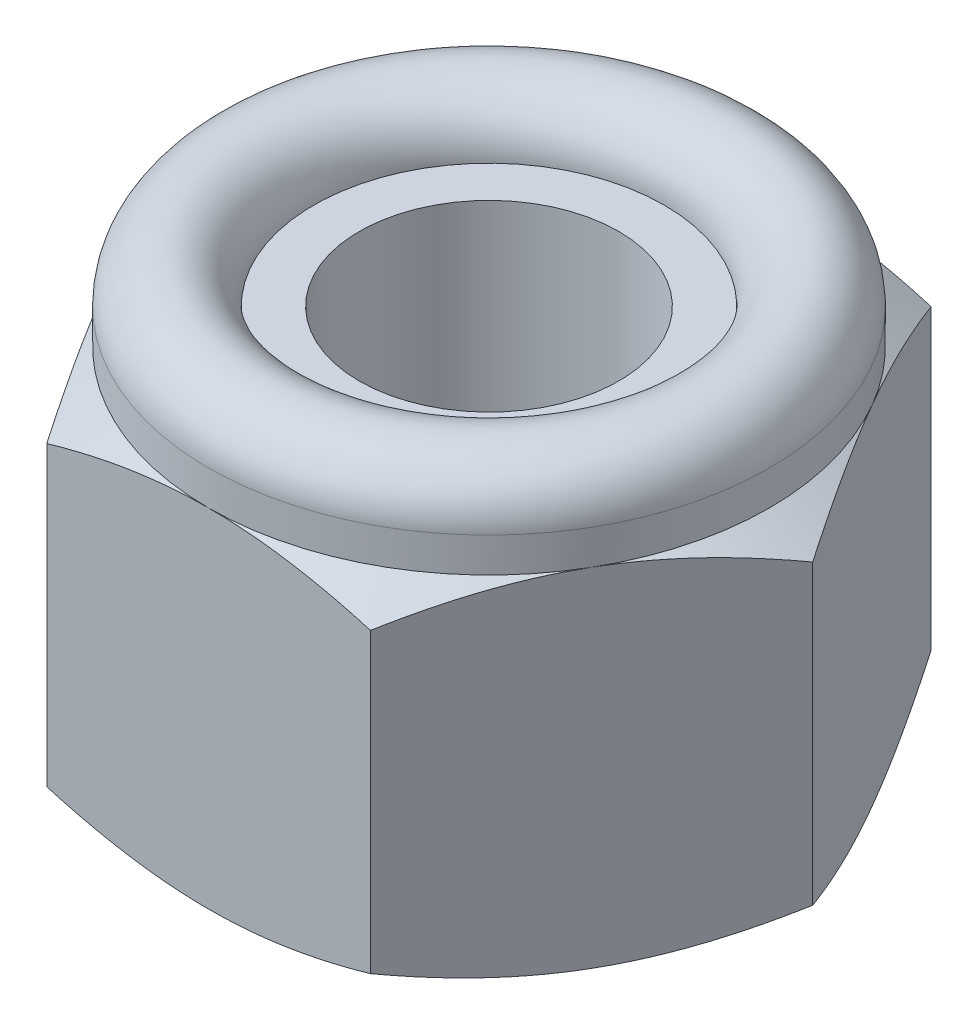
ISO-10303-21;
HEADER;
FILE_DESCRIPTION(('STEP AP214'),'2;1');
FILE_NAME('part.step','',(''),(''),'','','');
FILE_SCHEMA(('AUTOMOTIVE_DESIGN { 1 0 10303 214 1 1 1 1 }'));
ENDSEC;
DATA;
#1=APPLICATION_CONTEXT('core data for automotive mechanical design processes');
#2=APPLICATION_PROTOCOL_DEFINITION('international standard','automotive_design',2000,#1);
#3=PRODUCT_CONTEXT('',#1,'mechanical');
#4=PRODUCT('Part','Part','',(#3));
#5=PRODUCT_RELATED_PRODUCT_CATEGORY('part','',(#4));
#6=PRODUCT_DEFINITION_FORMATION('','',#4);
#7=PRODUCT_DEFINITION_CONTEXT('part definition',#1,'design');
#8=PRODUCT_DEFINITION('design','',#6,#7);
#9=PRODUCT_DEFINITION_SHAPE('','',#8);
#10=(LENGTH_UNIT() NAMED_UNIT(*) SI_UNIT(.MILLI.,.METRE.));
#11=(NAMED_UNIT(*) PLANE_ANGLE_UNIT() SI_UNIT($,.RADIAN.));
#12=(NAMED_UNIT(*) SI_UNIT($,.STERADIAN.) SOLID_ANGLE_UNIT());
#13=UNCERTAINTY_MEASURE_WITH_UNIT(LENGTH_MEASURE(1.E-05),#10,'distance_accuracy_value','');
#14=(GEOMETRIC_REPRESENTATION_CONTEXT(3) GLOBAL_UNCERTAINTY_ASSIGNED_CONTEXT((#13)) GLOBAL_UNIT_ASSIGNED_CONTEXT((#10,
#11,#12)) REPRESENTATION_CONTEXT('',''));
#15=CARTESIAN_POINT('',(0.,0.,0.));
#16=DIRECTION('',(0.,0.,1.));
#17=DIRECTION('',(1.,0.,0.));
#18=AXIS2_PLACEMENT_3D('',#15,#16,#17);
#19=CARTESIAN_POINT('',(0.,0.,0.));
#20=DIRECTION('',(0.,1.,0.));
#21=DIRECTION('',(0.,0.,1.));
#22=AXIS2_PLACEMENT_3D('',#19,#20,#21);
#23=CONICAL_SURFACE('',#22,8.,1.04719754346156);
#24=CARTESIAN_POINT('',(9.23771977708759,0.714597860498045,0.000200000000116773));
#25=CARTESIAN_POINT('',(9.13619343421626,0.655990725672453,-0.175648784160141));
#26=CARTESIAN_POINT('',(9.0342885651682,0.600043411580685,-0.352153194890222));
#27=CARTESIAN_POINT('',(8.82965122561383,0.494201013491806,-0.706595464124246));
#28=CARTESIAN_POINT('',(8.72691841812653,0.444308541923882,-0.884533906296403));
#29=CARTESIAN_POINT('',(8.41707512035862,0.304692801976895,-1.42119824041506));
#30=CARTESIAN_POINT('',(8.20874154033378,0.225281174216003,-1.78204258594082));
#31=CARTESIAN_POINT('',(7.89697436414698,0.132161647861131,-2.32203917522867));
#32=CARTESIAN_POINT('',(7.79447216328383,0.105634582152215,-2.4995781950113));
#33=CARTESIAN_POINT('',(7.58900421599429,0.0611531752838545,-2.85545911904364));
#34=CARTESIAN_POINT('',(7.4860385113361,0.0431980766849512,-3.03380095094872));
#35=CARTESIAN_POINT('',(7.27992981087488,0.0163156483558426,-3.39079169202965));
#36=CARTESIAN_POINT('',(7.1767871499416,0.00737807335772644,-3.56944002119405));
#37=CARTESIAN_POINT('',(6.97040654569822,-0.00127769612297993,-3.92690171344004));
#38=CARTESIAN_POINT('',(6.86716860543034,-0.000996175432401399,-4.10571507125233));
#39=CARTESIAN_POINT('',(6.67416138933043,0.00814502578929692,-4.44001337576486));
#40=CARTESIAN_POINT('',(6.58437849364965,0.0158896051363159,-4.59552191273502));
#41=CARTESIAN_POINT('',(6.40502298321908,0.0382011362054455,-4.90617476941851));
#42=CARTESIAN_POINT('',(6.3154503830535,0.0527685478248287,-5.06131906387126));
#43=CARTESIAN_POINT('',(6.04707935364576,0.106360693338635,-5.52615132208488));
#44=CARTESIAN_POINT('',(5.8687559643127,0.155268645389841,-5.83501649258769));
#45=CARTESIAN_POINT('',(5.51021755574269,0.277539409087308,-6.45602323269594));
#46=CARTESIAN_POINT('',(5.33004829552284,0.351420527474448,-6.76808554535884));
#47=CARTESIAN_POINT('',(4.97239658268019,0.519100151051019,-7.38755648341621));
#48=CARTESIAN_POINT('',(4.79490954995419,0.612859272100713,-7.6949730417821));
#49=CARTESIAN_POINT('',(4.61868668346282,0.71459786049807,-8.00020000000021));
#50=B_SPLINE_CURVE_WITH_KNOTS('',3,(#24,#25,#26,#27,#28,#29,#30,#31,#32,#33,#34,#35,#36,#37,#38,
#39,#40,#41,#42,#43,#44,#45,#46,#47,#48,#49),.UNSPECIFIED.,.F.,.F.,(4,2,2,2,2,2,2,2,2,2,2,2,4),
(0.,0.63397354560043,1.26821966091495,2.53934713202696,3.15934344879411,3.77928497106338,
4.39852135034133,5.01773859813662,5.55680240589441,6.09590255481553,7.17487078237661,
8.27776850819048,9.37850115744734),.UNSPECIFIED.);
#51=CARTESIAN_POINT('',(9.23760430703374,0.714531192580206,0.));
#52=VERTEX_POINT('',#51);
#53=CARTESIAN_POINT('',(6.92820323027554,0.,-3.99999999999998));
#54=VERTEX_POINT('',#53);
#55=EDGE_CURVE('E233',#52,#54,#50,.T.);
#56=ORIENTED_EDGE('',*,*,#55,.F.);
#57=CARTESIAN_POINT('',(4.61868668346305,0.71459786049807,8.00019999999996));
#58=CARTESIAN_POINT('',(4.72021302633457,0.655990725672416,7.82435121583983));
#59=CARTESIAN_POINT('',(4.82211789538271,0.60004341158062,7.6478468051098));
#60=CARTESIAN_POINT('',(5.02675523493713,0.494201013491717,7.29340453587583));
#61=CARTESIAN_POINT('',(5.12948804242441,0.444308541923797,7.11546609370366));
#62=CARTESIAN_POINT('',(5.43933134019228,0.304692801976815,6.578801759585));
#63=CARTESIAN_POINT('',(5.64766492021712,0.225281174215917,6.21795741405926));
#64=CARTESIAN_POINT('',(5.95943209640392,0.132161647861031,5.67796082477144));
#65=CARTESIAN_POINT('',(6.06193429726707,0.105634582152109,5.50042180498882));
#66=CARTESIAN_POINT('',(6.2674022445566,0.0611531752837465,5.14454088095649));
#67=CARTESIAN_POINT('',(6.37036794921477,0.0431980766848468,4.96619904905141));
#68=CARTESIAN_POINT('',(6.57647664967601,0.0163156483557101,4.6092083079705));
#69=CARTESIAN_POINT('',(6.67961931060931,0.00737807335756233,4.43055997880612));
#70=CARTESIAN_POINT('',(6.88599991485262,-0.00127769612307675,4.0730982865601));
#71=CARTESIAN_POINT('',(6.9892378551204,-0.0009961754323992,3.89428492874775));
#72=CARTESIAN_POINT('',(7.18224507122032,0.00814502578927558,3.55998662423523));
#73=CARTESIAN_POINT('',(7.27202796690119,0.0158896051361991,3.40447808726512));
#74=CARTESIAN_POINT('',(7.45138347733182,0.0382011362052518,3.09382523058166));
#75=CARTESIAN_POINT('',(7.54095607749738,0.0527685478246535,2.9386809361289));
#76=CARTESIAN_POINT('',(7.80932710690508,0.106360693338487,2.47384867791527));
#77=CARTESIAN_POINT('',(7.98765049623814,0.155268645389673,2.16498350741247));
#78=CARTESIAN_POINT('',(8.34618890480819,0.277539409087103,1.54397676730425));
#79=CARTESIAN_POINT('',(8.52635816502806,0.351420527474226,1.23191445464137));
#80=CARTESIAN_POINT('',(8.88400987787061,0.51910015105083,0.612443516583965));
#81=CARTESIAN_POINT('',(9.06149691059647,0.612859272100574,0.305026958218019));
#82=CARTESIAN_POINT('',(9.23771977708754,0.714597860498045,-0.000200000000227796));
#83=B_SPLINE_CURVE_WITH_KNOTS('',3,(#57,#58,#59,#60,#61,#62,#63,#64,#65,#66,#67,#68,#69,#70,#71,
#72,#73,#74,#75,#76,#77,#78,#79,#80,#81,#82),.UNSPECIFIED.,.F.,.F.,(4,2,2,2,2,2,2,2,2,2,2,2,4),
(0.,0.633973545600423,1.26821966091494,2.5393471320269,3.15934344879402,3.77928497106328,
4.39852135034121,5.01773859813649,5.55680240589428,6.0959025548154,7.17487078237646,
8.2777685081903,9.37850115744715),.UNSPECIFIED.);
#84=CARTESIAN_POINT('',(6.92820323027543,0.,4.));
#85=VERTEX_POINT('',#84);
#86=EDGE_CURVE('E149',#85,#52,#83,.T.);
#87=ORIENTED_EDGE('',*,*,#86,.F.);
#88=CARTESIAN_POINT('',(0.,0.,0.));
#89=DIRECTION('',(0.,-1.,0.));
#90=DIRECTION('',(0.,0.,-1.));
#91=AXIS2_PLACEMENT_3D('',#88,#89,#90);
#92=CIRCLE('',#91,8.);
#93=EDGE_CURVE('E246',#54,#85,#92,.T.);
#94=ORIENTED_EDGE('',*,*,#93,.F.);
#95=EDGE_LOOP('',(#56,#87,#94));
#96=FACE_BOUND('',#95,.T.);
#97=ADVANCED_FACE('F31',(#96),#23,.T.);
#98=CARTESIAN_POINT('',(4.61880215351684,0.714531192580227,-7.99999999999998));
#99=VERTEX_POINT('',#98);
#100=EDGE_CURVE('E228',#54,#99,#50,.T.);
#101=ORIENTED_EDGE('',*,*,#100,.F.);
#102=CARTESIAN_POINT('',(-9.43689570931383E-13,0.,-8.00000000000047));
#103=VERTEX_POINT('',#102);
#104=EDGE_CURVE('E244',#103,#54,#92,.T.);
#105=ORIENTED_EDGE('',*,*,#104,.F.);
#106=CARTESIAN_POINT('',(-12.4167804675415,3.90912140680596,-8.00000000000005));
#107=CARTESIAN_POINT('',(-12.0672904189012,3.73954675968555,-8.00000000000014));
#108=CARTESIAN_POINT('',(-11.7169992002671,3.57159510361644,-8.00000000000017));
#109=CARTESIAN_POINT('',(-11.0143884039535,3.23985034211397,-8.0000000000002));
#110=CARTESIAN_POINT('',(-10.662068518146,3.0760578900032,-8.00000000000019));
#111=CARTESIAN_POINT('',(-9.95316389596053,2.75272220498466,-8.00000000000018));
#112=CARTESIAN_POINT('',(-9.59656638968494,2.59320687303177,-8.00000000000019));
#113=CARTESIAN_POINT('',(-8.88053881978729,2.28069032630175,-8.00000000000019));
#114=CARTESIAN_POINT('',(-8.52110889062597,2.1276888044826,-8.00000000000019));
#115=CARTESIAN_POINT('',(-7.78718797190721,1.82511354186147,-8.00000000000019));
#116=CARTESIAN_POINT('',(-7.41258514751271,1.67580956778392,-8.00000000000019));
#117=CARTESIAN_POINT('',(-6.65900149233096,1.38847696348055,-8.00000000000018));
#118=CARTESIAN_POINT('',(-6.28002017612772,1.25044959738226,-8.00000000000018));
#119=CARTESIAN_POINT('',(-5.51777815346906,0.989286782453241,-8.0000000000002));
#120=CARTESIAN_POINT('',(-5.13452785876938,0.866121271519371,-8.00000000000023));
#121=CARTESIAN_POINT('',(-4.36254331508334,0.638626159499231,-8.00000000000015));
#122=CARTESIAN_POINT('',(-3.97381083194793,0.534290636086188,-8.00000000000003));
#123=CARTESIAN_POINT('',(-3.1927450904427,0.350020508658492,-8.00000000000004));
#124=CARTESIAN_POINT('',(-2.80044412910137,0.269952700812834,-8.00000000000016));
#125=CARTESIAN_POINT('',(-2.20841205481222,0.17151093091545,-8.0000000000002));
#126=CARTESIAN_POINT('',(-2.01045675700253,0.142305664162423,-8.00000000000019));
#127=CARTESIAN_POINT('',(-1.61355877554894,0.0916877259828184,-8.00000000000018));
#128=CARTESIAN_POINT('',(-1.41461618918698,0.0702743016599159,-8.00000000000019));
#129=CARTESIAN_POINT('',(-1.01861322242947,0.0359357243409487,-8.00000000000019));
#130=CARTESIAN_POINT('',(-0.821562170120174,0.0229034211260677,-8.00000000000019));
#131=CARTESIAN_POINT('',(-0.427085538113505,0.00518384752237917,-8.00000000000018));
#132=CARTESIAN_POINT('',(-0.229659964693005,0.000496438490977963,-8.00000000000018));
#133=CARTESIAN_POINT('',(0.165212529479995,-0.000421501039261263,-8.0000000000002));
#134=CARTESIAN_POINT('',(0.362659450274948,0.00334798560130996,-8.00000000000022));
#135=CARTESIAN_POINT('',(0.757218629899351,0.019251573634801,-8.00000000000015));
#136=CARTESIAN_POINT('',(0.954330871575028,0.031386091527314,-8.00000000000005));
#137=CARTESIAN_POINT('',(1.42775544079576,0.070319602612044,-8.00000000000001));
#138=CARTESIAN_POINT('',(1.70374960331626,0.101071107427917,-8.00000000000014));
#139=CARTESIAN_POINT('',(2.25368308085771,0.177298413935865,-8.00000000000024));
#140=CARTESIAN_POINT('',(2.52762211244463,0.2227762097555,-8.0000000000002));
#141=CARTESIAN_POINT('',(3.34604788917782,0.378887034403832,-8.00000000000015));
#142=CARTESIAN_POINT('',(3.88683594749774,0.509168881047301,-8.00000000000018));
#143=CARTESIAN_POINT('',(4.695445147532,0.735008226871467,-8.00000000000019));
#144=CARTESIAN_POINT('',(4.96746291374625,0.816403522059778,-8.00000000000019));
#145=CARTESIAN_POINT('',(5.50885646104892,0.9876295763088,-8.00000000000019));
#146=CARTESIAN_POINT('',(5.77823222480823,1.07746039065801,-8.00000000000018));
#147=CARTESIAN_POINT('',(6.31442655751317,1.26411776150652,-8.00000000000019));
#148=CARTESIAN_POINT('',(6.58124594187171,1.36094199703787,-8.00000000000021));
#149=CARTESIAN_POINT('',(7.11267558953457,1.56044886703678,-8.00000000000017));
#150=CARTESIAN_POINT('',(7.37728587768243,1.66313143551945,-8.0000000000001));
#151=CARTESIAN_POINT('',(7.997388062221,1.91040587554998,-8.00000000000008));
#152=CARTESIAN_POINT('',(8.35207087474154,2.05702285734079,-8.00000000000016));
#153=CARTESIAN_POINT('',(9.05844713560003,2.35730974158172,-8.00000000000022));
#154=CARTESIAN_POINT('',(9.41014040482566,2.51098006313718,-8.0000000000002));
#155=CARTESIAN_POINT('',(10.1110880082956,2.82397393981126,-8.00000000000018));
#156=CARTESIAN_POINT('',(10.4603417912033,2.98329872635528,-8.00000000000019));
#157=CARTESIAN_POINT('',(11.156736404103,3.30647150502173,-8.00000000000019));
#158=CARTESIAN_POINT('',(11.5038772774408,3.47031940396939,-8.00000000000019));
#159=CARTESIAN_POINT('',(12.196766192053,3.80187654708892,-8.00000000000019));
#160=CARTESIAN_POINT('',(12.5425123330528,3.96958975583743,-8.00000000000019));
#161=CARTESIAN_POINT('',(13.2325145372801,4.30805667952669,-8.00000000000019));
#162=CARTESIAN_POINT('',(13.5767705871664,4.47881042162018,-8.00000000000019));
#163=CARTESIAN_POINT('',(14.6075665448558,4.99478520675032,-8.00000000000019));
#164=CARTESIAN_POINT('',(15.2922253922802,5.34376377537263,-8.00000000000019));
#165=CARTESIAN_POINT('',(16.6012395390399,6.01954126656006,-8.00000000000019));
#166=CARTESIAN_POINT('',(17.2258859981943,6.34577871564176,-8.00000000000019));
#167=CARTESIAN_POINT('',(18.4728402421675,7.00274168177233,-8.00000000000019));
#168=CARTESIAN_POINT('',(19.0951479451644,7.3334673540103,-8.00000000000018));
#169=CARTESIAN_POINT('',(20.3364009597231,7.99752000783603,-8.00000000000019));
#170=CARTESIAN_POINT('',(20.9553507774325,8.33083857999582,-8.0000000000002));
#171=CARTESIAN_POINT('',(22.1917522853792,9.00016359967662,-8.00000000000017));
#172=CARTESIAN_POINT('',(22.8092040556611,9.33616989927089,-8.00000000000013));
#173=CARTESIAN_POINT('',(23.4261032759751,9.67318079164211,-8.00000000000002));
#174=B_SPLINE_CURVE_WITH_KNOTS('',3,(#106,#107,#108,#109,#110,#111,#112,#113,#114,#115,#116,
#117,#118,#119,#120,#121,#122,#123,#124,#125,#126,#127,#128,#129,#130,#131,#132,#133,#134,#135,
#136,#137,#138,#139,#140,#141,#142,#143,#144,#145,#146,#147,#148,#149,#150,#151,#152,#153,#154,
#155,#156,#157,#158,#159,#160,#161,#162,#163,#164,#165,#166,#167,#168,#169,#170,#171,#172,#173),
.UNSPECIFIED.,.F.,.F.,(4,2,2,2,2,2,2,2,2,2,2,2,2,2,2,2,2,2,2,2,2,2,2,2,2,2,2,2,2,2,2,2,2,4),(0.,
1.16538523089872,2.33095240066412,3.50284826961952,4.67468883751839,5.88432916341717,
7.09410490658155,8.30139100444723,9.50829672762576,10.7084525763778,11.3086176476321,
11.9087247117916,12.5009984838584,13.0932624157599,13.6855275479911,14.2778221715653,
15.110457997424,15.9432066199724,17.6096258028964,18.4613586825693,19.3130971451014,
20.1645542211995,21.0160017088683,22.1672759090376,23.3186186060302,24.4702135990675,
25.6217848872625,26.7745950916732,27.9274155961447,30.2327530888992,32.3468591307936,
34.4610384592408,36.5700125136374,38.6788712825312),.UNSPECIFIED.);
#175=EDGE_CURVE('E335',#99,#103,#174,.F.);
#176=ORIENTED_EDGE('',*,*,#175,.F.);
#177=EDGE_LOOP('',(#101,#105,#176));
#178=FACE_BOUND('',#177,.T.);
#179=ADVANCED_FACE('F265',(#178),#23,.T.);
#180=CARTESIAN_POINT('',(-4.61880215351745,0.71453119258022,-8.00000000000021));
#181=VERTEX_POINT('',#180);
#182=EDGE_CURVE('E205',#103,#181,#174,.F.);
#183=ORIENTED_EDGE('',*,*,#182,.F.);
#184=CARTESIAN_POINT('',(-6.92820323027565,0.,-4.00000000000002));
#185=VERTEX_POINT('',#184);
#186=EDGE_CURVE('E242',#185,#103,#92,.T.);
#187=ORIENTED_EDGE('',*,*,#186,.F.);
#188=CARTESIAN_POINT('',(-4.61868668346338,0.714597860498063,-8.00020000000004));
#189=CARTESIAN_POINT('',(-4.7202130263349,0.655990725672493,-7.82435121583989));
#190=CARTESIAN_POINT('',(-4.82211789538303,0.600043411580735,-7.64784680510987));
#191=CARTESIAN_POINT('',(-5.02675523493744,0.494201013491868,-7.2934045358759));
#192=CARTESIAN_POINT('',(-5.12948804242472,0.444308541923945,-7.11546609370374));
#193=CARTESIAN_POINT('',(-5.43933134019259,0.304692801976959,-6.5788017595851));
#194=CARTESIAN_POINT('',(-5.64766492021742,0.22528117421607,-6.21795741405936));
#195=CARTESIAN_POINT('',(-5.95943209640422,0.132161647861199,-5.67796082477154));
#196=CARTESIAN_POINT('',(-6.06193429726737,0.105634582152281,-5.50042180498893));
#197=CARTESIAN_POINT('',(-6.26740224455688,0.0611531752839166,-5.1445408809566));
#198=CARTESIAN_POINT('',(-6.37036794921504,0.0431980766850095,-4.96619904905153));
#199=CARTESIAN_POINT('',(-6.5764766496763,0.0163156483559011,-4.60920830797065));
#200=CARTESIAN_POINT('',(-6.67961931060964,0.00737807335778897,-4.4305599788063));
#201=CARTESIAN_POINT('',(-6.88599991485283,-0.00127769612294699,-4.07309828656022));
#202=CARTESIAN_POINT('',(-6.98923785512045,-0.000996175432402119,-3.89428492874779));
#203=CARTESIAN_POINT('',(-7.18224507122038,0.00814502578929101,-3.5599866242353));
#204=CARTESIAN_POINT('',(-7.27202796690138,0.0158896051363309,-3.40447808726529));
#205=CARTESIAN_POINT('',(-7.4513834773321,0.0382011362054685,-3.09382523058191));
#206=CARTESIAN_POINT('',(-7.54095607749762,0.0527685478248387,-2.93868093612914));
#207=CARTESIAN_POINT('',(-7.80932710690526,0.106360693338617,-2.4738486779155));
#208=CARTESIAN_POINT('',(-7.98765049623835,0.155268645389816,-2.16498350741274));
#209=CARTESIAN_POINT('',(-8.34618890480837,0.277539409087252,-1.54397676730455));
#210=CARTESIAN_POINT('',(-8.52635816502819,0.351420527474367,-1.23191445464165));
#211=CARTESIAN_POINT('',(-8.88400987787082,0.519100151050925,-0.612443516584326));
#212=CARTESIAN_POINT('',(-9.06149691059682,0.61285927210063,-0.305026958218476));
#213=CARTESIAN_POINT('',(-9.23771977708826,0.714597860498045,0.000199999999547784));
#214=B_SPLINE_CURVE_WITH_KNOTS('',3,(#188,#189,#190,#191,#192,#193,#194,#195,#196,#197,#198,
#199,#200,#201,#202,#203,#204,#205,#206,#207,#208,#209,#210,#211,#212,#213),.UNSPECIFIED.,.F.,
.F.,(4,2,2,2,2,2,2,2,2,2,2,2,4),(0.,0.633973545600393,1.26821966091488,2.53934713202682,
3.15934344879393,3.77928497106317,4.39852135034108,5.01773859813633,5.55680240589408,
6.09590255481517,7.17487078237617,8.27776850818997,9.37850115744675),.UNSPECIFIED.);
#215=EDGE_CURVE('E200',#181,#185,#214,.T.);
#216=ORIENTED_EDGE('',*,*,#215,.F.);
#217=EDGE_LOOP('',(#183,#187,#216));
#218=FACE_BOUND('',#217,.T.);
#219=ADVANCED_FACE('F270',(#218),#23,.T.);
#220=CARTESIAN_POINT('',(-9.2376043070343,0.714531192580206,-3.88578058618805E-13));
#221=VERTEX_POINT('',#220);
#222=EDGE_CURVE('E201',#185,#221,#214,.T.);
#223=ORIENTED_EDGE('',*,*,#222,.F.);
#224=CARTESIAN_POINT('',(-6.92820323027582,0.,3.99999999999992));
#225=VERTEX_POINT('',#224);
#226=EDGE_CURVE('E307',#225,#185,#92,.T.);
#227=ORIENTED_EDGE('',*,*,#226,.F.);
#228=CARTESIAN_POINT('',(-9.23771977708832,0.714597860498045,-0.000200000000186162));
#229=CARTESIAN_POINT('',(-9.13619343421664,0.655990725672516,0.175648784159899));
#230=CARTESIAN_POINT('',(-9.03428856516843,0.600043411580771,0.35215319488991));
#231=CARTESIAN_POINT('',(-8.82965122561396,0.494201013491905,0.706595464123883));
#232=CARTESIAN_POINT('',(-8.72691841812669,0.444308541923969,0.88453390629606));
#233=CARTESIAN_POINT('',(-8.41707512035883,0.304692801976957,1.42119824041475));
#234=CARTESIAN_POINT('',(-8.20874154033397,0.225281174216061,1.78204258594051));
#235=CARTESIAN_POINT('',(-7.89697436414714,0.132161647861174,2.32203917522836));
#236=CARTESIAN_POINT('',(-7.79447216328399,0.105634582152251,2.49957819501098));
#237=CARTESIAN_POINT('',(-7.58900421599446,0.0611531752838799,2.85545911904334));
#238=CARTESIAN_POINT('',(-7.48603851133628,0.0431980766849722,3.03380095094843));
#239=CARTESIAN_POINT('',(-7.27992981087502,0.0163156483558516,3.39079169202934));
#240=CARTESIAN_POINT('',(-7.17678714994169,0.00737807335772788,3.56944002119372));
#241=CARTESIAN_POINT('',(-6.97040654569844,-0.00127769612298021,3.92690171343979));
#242=CARTESIAN_POINT('',(-6.86716860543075,-0.00099617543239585,4.1057150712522));
#243=CARTESIAN_POINT('',(-6.67416138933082,0.00814502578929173,4.44001337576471));
#244=CARTESIAN_POINT('',(-6.58437849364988,0.0158896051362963,4.59552191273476));
#245=CARTESIAN_POINT('',(-6.40502298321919,0.0382011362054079,4.90617476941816));
#246=CARTESIAN_POINT('',(-6.31545038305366,0.0527685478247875,5.06131906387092));
#247=CARTESIAN_POINT('',(-6.047079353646,0.106360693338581,5.52615132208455));
#248=CARTESIAN_POINT('',(-5.86875596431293,0.155268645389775,5.83501649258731));
#249=CARTESIAN_POINT('',(-5.5102175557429,0.277539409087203,6.4560232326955));
#250=CARTESIAN_POINT('',(-5.33004829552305,0.351420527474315,6.76808554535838));
#251=CARTESIAN_POINT('',(-4.97239658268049,0.519100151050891,7.38755648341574));
#252=CARTESIAN_POINT('',(-4.7949095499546,0.612859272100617,7.69497304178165));
#253=CARTESIAN_POINT('',(-4.61868668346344,0.714597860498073,8.00019999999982));
#254=B_SPLINE_CURVE_WITH_KNOTS('',3,(#228,#229,#230,#231,#232,#233,#234,#235,#236,#237,#238,
#239,#240,#241,#242,#243,#244,#245,#246,#247,#248,#249,#250,#251,#252,#253),.UNSPECIFIED.,.F.,
.F.,(4,2,2,2,2,2,2,2,2,2,2,2,4),(0.,0.633973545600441,1.26821966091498,2.53934713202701,
3.15934344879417,3.77928497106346,4.39852135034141,5.01773859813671,5.55680240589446,
6.09590255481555,7.17487078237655,8.27776850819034,9.37850115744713),.UNSPECIFIED.);
#255=EDGE_CURVE('E302',#221,#225,#254,.T.);
#256=ORIENTED_EDGE('',*,*,#255,.F.);
#257=EDGE_LOOP('',(#223,#227,#256));
#258=FACE_BOUND('',#257,.T.);
#259=ADVANCED_FACE('F282',(#258),#23,.T.);
#260=CARTESIAN_POINT('',(-4.61880215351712,0.71453119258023,7.99999999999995));
#261=VERTEX_POINT('',#260);
#262=EDGE_CURVE('E294',#225,#261,#254,.T.);
#263=ORIENTED_EDGE('',*,*,#262,.F.);
#264=CARTESIAN_POINT('',(0.,0.,7.99999999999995));
#265=VERTEX_POINT('',#264);
#266=EDGE_CURVE('E297',#265,#225,#92,.T.);
#267=ORIENTED_EDGE('',*,*,#266,.F.);
#268=CARTESIAN_POINT('',(-12.4167804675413,3.90912140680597,7.99999999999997));
#269=CARTESIAN_POINT('',(-12.067290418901,3.73954675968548,7.99999999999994));
#270=CARTESIAN_POINT('',(-11.716999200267,3.57159510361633,7.99999999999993));
#271=CARTESIAN_POINT('',(-11.0143884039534,3.23985034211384,7.99999999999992));
#272=CARTESIAN_POINT('',(-10.662068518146,3.07605789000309,7.99999999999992));
#273=CARTESIAN_POINT('',(-9.95316389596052,2.75272220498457,7.99999999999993));
#274=CARTESIAN_POINT('',(-9.59656638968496,2.59320687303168,7.99999999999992));
#275=CARTESIAN_POINT('',(-8.88053881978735,2.28069032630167,7.99999999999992));
#276=CARTESIAN_POINT('',(-8.52110889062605,2.12768880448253,7.99999999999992));
#277=CARTESIAN_POINT('',(-7.78718797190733,1.82511354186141,7.99999999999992));
#278=CARTESIAN_POINT('',(-7.41258514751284,1.67580956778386,7.99999999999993));
#279=CARTESIAN_POINT('',(-6.65900149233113,1.3884769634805,7.99999999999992));
#280=CARTESIAN_POINT('',(-6.28002017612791,1.25044959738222,7.99999999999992));
#281=CARTESIAN_POINT('',(-5.51777815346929,0.989286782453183,7.99999999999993));
#282=CARTESIAN_POINT('',(-5.13452785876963,0.866121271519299,7.99999999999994));
#283=CARTESIAN_POINT('',(-4.36254331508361,0.638626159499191,7.99999999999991));
#284=CARTESIAN_POINT('',(-3.9738108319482,0.534290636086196,7.99999999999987));
#285=CARTESIAN_POINT('',(-3.19274509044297,0.350020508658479,7.99999999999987));
#286=CARTESIAN_POINT('',(-2.80044412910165,0.269952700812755,7.99999999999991));
#287=CARTESIAN_POINT('',(-2.20841205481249,0.171510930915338,7.99999999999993));
#288=CARTESIAN_POINT('',(-2.0104567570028,0.14230566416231,7.99999999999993));
#289=CARTESIAN_POINT('',(-1.6135587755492,0.0916877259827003,7.99999999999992));
#290=CARTESIAN_POINT('',(-1.41461618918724,0.0702743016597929,7.99999999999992));
#291=CARTESIAN_POINT('',(-1.01861322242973,0.0359357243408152,7.99999999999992));
#292=CARTESIAN_POINT('',(-0.821562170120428,0.0229034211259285,7.99999999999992));
#293=CARTESIAN_POINT('',(-0.427085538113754,0.00518384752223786,7.99999999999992));
#294=CARTESIAN_POINT('',(-0.229659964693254,0.000496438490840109,7.99999999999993));
#295=CARTESIAN_POINT('',(0.165212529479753,-0.000421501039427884,7.99999999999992));
#296=CARTESIAN_POINT('',(0.362659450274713,0.00334798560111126,7.99999999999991));
#297=CARTESIAN_POINT('',(0.757218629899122,0.019251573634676,7.99999999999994));
#298=CARTESIAN_POINT('',(0.954330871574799,0.031386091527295,7.99999999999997));
#299=CARTESIAN_POINT('',(1.42775544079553,0.0703196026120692,7.99999999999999));
#300=CARTESIAN_POINT('',(1.70374960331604,0.101071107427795,7.99999999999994));
#301=CARTESIAN_POINT('',(2.25368308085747,0.177298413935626,7.99999999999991));
#302=CARTESIAN_POINT('',(2.52762211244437,0.222776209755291,7.99999999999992));
#303=CARTESIAN_POINT('',(3.34604788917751,0.378887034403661,7.99999999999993));
#304=CARTESIAN_POINT('',(3.8868359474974,0.509168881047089,7.99999999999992));
#305=CARTESIAN_POINT('',(4.69544514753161,0.735008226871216,7.99999999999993));
#306=CARTESIAN_POINT('',(4.96746291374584,0.816403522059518,7.99999999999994));
#307=CARTESIAN_POINT('',(5.50885646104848,0.987629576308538,7.99999999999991));
#308=CARTESIAN_POINT('',(5.77823222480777,1.07746039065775,7.99999999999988));
#309=CARTESIAN_POINT('',(6.31442655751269,1.26411776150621,7.99999999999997));
#310=CARTESIAN_POINT('',(6.58124594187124,1.36094199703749,8.0000000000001));
#311=CARTESIAN_POINT('',(7.11267558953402,1.56044886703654,7.99999999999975));
#312=CARTESIAN_POINT('',(7.37728587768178,1.66313143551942,7.99999999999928));
#313=CARTESIAN_POINT('',(7.99738806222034,1.91040587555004,7.99999999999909));
#314=CARTESIAN_POINT('',(8.35207087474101,2.05702285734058,7.9999999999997));
#315=CARTESIAN_POINT('',(9.05844713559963,2.35730974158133,8.00000000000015));
#316=CARTESIAN_POINT('',(9.41014040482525,2.51098006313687,7.99999999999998));
#317=CARTESIAN_POINT('',(10.1110880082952,2.82397393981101,7.99999999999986));
#318=CARTESIAN_POINT('',(10.4603417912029,2.98329872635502,7.99999999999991));
#319=CARTESIAN_POINT('',(11.1567364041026,3.30647150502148,7.99999999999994));
#320=CARTESIAN_POINT('',(11.5038772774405,3.47031940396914,7.99999999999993));
#321=CARTESIAN_POINT('',(12.1967661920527,3.8018765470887,7.99999999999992));
#322=CARTESIAN_POINT('',(12.5425123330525,3.96958975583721,7.99999999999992));
#323=CARTESIAN_POINT('',(13.2325145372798,4.30805667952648,7.99999999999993));
#324=CARTESIAN_POINT('',(13.5767705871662,4.47881042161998,7.99999999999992));
#325=CARTESIAN_POINT('',(14.6075665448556,4.99478520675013,7.99999999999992));
#326=CARTESIAN_POINT('',(15.29222539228,5.34376377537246,7.99999999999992));
#327=CARTESIAN_POINT('',(16.6012395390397,6.01954126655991,7.99999999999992));
#328=CARTESIAN_POINT('',(17.2258859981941,6.34577871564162,7.99999999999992));
#329=CARTESIAN_POINT('',(18.4728402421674,7.0027416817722,7.99999999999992));
#330=CARTESIAN_POINT('',(19.0951479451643,7.33346735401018,7.99999999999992));
#331=CARTESIAN_POINT('',(20.336400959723,7.99752000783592,7.99999999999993));
#332=CARTESIAN_POINT('',(20.9553507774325,8.33083857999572,7.99999999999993));
#333=CARTESIAN_POINT('',(22.1917522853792,9.00016359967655,7.99999999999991));
#334=CARTESIAN_POINT('',(22.809204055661,9.33616989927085,7.99999999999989));
#335=CARTESIAN_POINT('',(23.4261032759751,9.67318079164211,7.99999999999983));
#336=B_SPLINE_CURVE_WITH_KNOTS('',3,(#268,#269,#270,#271,#272,#273,#274,#275,#276,#277,#278,
#279,#280,#281,#282,#283,#284,#285,#286,#287,#288,#289,#290,#291,#292,#293,#294,#295,#296,#297,
#298,#299,#300,#301,#302,#303,#304,#305,#306,#307,#308,#309,#310,#311,#312,#313,#314,#315,#316,
#317,#318,#319,#320,#321,#322,#323,#324,#325,#326,#327,#328,#329,#330,#331,#332,#333,#334,#335),
.UNSPECIFIED.,.F.,.F.,(4,2,2,2,2,2,2,2,2,2,2,2,2,2,2,2,2,2,2,2,2,2,2,2,2,2,2,2,2,2,2,2,2,4),(0.,
1.16538523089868,2.33095240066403,3.50284826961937,4.67468883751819,5.8843291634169,
7.09410490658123,8.30139100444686,9.50829672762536,10.7084525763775,11.3086176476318,
11.9087247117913,12.5009984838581,13.0932624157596,13.6855275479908,14.2778221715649,
15.1104579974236,15.9432066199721,17.6096258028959,18.4613586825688,19.3130971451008,
20.1645542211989,21.0160017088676,22.167275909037,23.3186186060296,24.470213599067,
25.621784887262,26.7745950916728,27.9274155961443,30.2327530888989,32.3468591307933,
34.4610384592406,36.5700125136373,38.6788712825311),.UNSPECIFIED.);
#337=EDGE_CURVE('E141',#261,#265,#336,.T.);
#338=ORIENTED_EDGE('',*,*,#337,.F.);
#339=EDGE_LOOP('',(#263,#267,#338));
#340=FACE_BOUND('',#339,.T.);
#341=ADVANCED_FACE('F276',(#340),#23,.T.);
#342=CARTESIAN_POINT('',(-1.66533453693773E-13,8.,0.));
#343=DIRECTION('',(0.,-1.,0.));
#344=DIRECTION('',(0.,0.,-1.));
#345=AXIS2_PLACEMENT_3D('',#342,#343,#344);
#346=CONICAL_SURFACE('',#345,11.3137084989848,1.04719755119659);
#347=CARTESIAN_POINT('',(-9.23771977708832,9.19857264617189,0.000199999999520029));
#348=CARTESIAN_POINT('',(-9.13619343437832,9.25717977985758,-0.175648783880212));
#349=CARTESIAN_POINT('',(-9.03428856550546,9.31312709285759,-0.35215319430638));
#350=CARTESIAN_POINT('',(-8.82965122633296,9.41896948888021,-0.706595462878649));
#351=CARTESIAN_POINT('',(-8.72691841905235,9.46886195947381,-0.884533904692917));
#352=CARTESIAN_POINT('',(-8.41707512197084,9.608477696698,-1.42119823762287));
#353=CARTESIAN_POINT('',(-8.20874154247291,9.68788932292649,-1.78204258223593));
#354=CARTESIAN_POINT('',(-7.89697436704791,9.78100884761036,-2.32203917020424));
#355=CARTESIAN_POINT('',(-7.79447216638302,9.80753591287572,-2.49957818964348));
#356=CARTESIAN_POINT('',(-7.58900421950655,9.85201731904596,-2.85545911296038));
#357=CARTESIAN_POINT('',(-7.48603851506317,9.86997241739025,-3.03380094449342));
#358=CARTESIAN_POINT('',(-7.27992981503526,9.89685484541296,-3.39079168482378));
#359=CARTESIAN_POINT('',(-7.17678715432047,9.90579242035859,-3.56944001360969));
#360=CARTESIAN_POINT('',(-6.9704065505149,9.91444818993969,-3.92690170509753));
#361=CARTESIAN_POINT('',(-6.86716861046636,9.91416666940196,-4.10571506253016));
#362=CARTESIAN_POINT('',(-6.67416139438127,9.90502546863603,-4.440013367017));
#363=CARTESIAN_POINT('',(-6.58437849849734,9.89728088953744,-4.59552190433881));
#364=CARTESIAN_POINT('',(-6.40502298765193,9.87496935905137,-4.90617476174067));
#365=CARTESIAN_POINT('',(-6.31545038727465,9.86040194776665,-5.06131905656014));
#366=CARTESIAN_POINT('',(-6.04707935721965,9.80680980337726,-5.52615131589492));
#367=CARTESIAN_POINT('',(-5.86875596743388,9.75790185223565,-5.83501648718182));
#368=CARTESIAN_POINT('',(-5.51021755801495,9.63563109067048,-6.45602322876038));
#369=CARTESIAN_POINT('',(-5.33004829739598,9.56174997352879,-6.76808554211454));
#370=CARTESIAN_POINT('',(-4.97239658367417,9.39407035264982,-7.3875564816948));
#371=CARTESIAN_POINT('',(-4.79490955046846,9.30031123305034,-7.69497304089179));
#372=CARTESIAN_POINT('',(-4.61868668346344,9.19857264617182,-8.00020000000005));
#373=B_SPLINE_CURVE_WITH_KNOTS('',3,(#347,#348,#349,#350,#351,#352,#353,#354,#355,#356,#357,
#358,#359,#360,#361,#362,#363,#364,#365,#366,#367,#368,#369,#370,#371,#372),.UNSPECIFIED.,.F.,
.F.,(4,2,2,2,2,2,2,2,2,2,2,2,4),(0.,0.633973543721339,1.26821965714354,2.53934712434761,
3.15934343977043,3.77928496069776,4.39852133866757,5.01773858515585,5.55680239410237,
6.09590254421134,7.17487077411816,8.2777685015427,9.37850115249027),.UNSPECIFIED.);
#374=CARTESIAN_POINT('',(-9.23760430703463,9.19863931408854,-8.46545056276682E-13));
#375=VERTEX_POINT('',#374);
#376=CARTESIAN_POINT('',(-6.92820322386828,9.91317050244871,-3.99999999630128));
#377=VERTEX_POINT('',#376);
#378=EDGE_CURVE('E362',#375,#377,#373,.T.);
#379=ORIENTED_EDGE('',*,*,#378,.F.);
#380=CARTESIAN_POINT('',(-4.61868668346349,9.19857264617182,8.00019999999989));
#381=CARTESIAN_POINT('',(-4.72021302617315,9.25717977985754,7.82435121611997));
#382=CARTESIAN_POINT('',(-4.82211789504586,9.31312709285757,7.64784680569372));
#383=CARTESIAN_POINT('',(-5.02675523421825,9.41896948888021,7.29340453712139));
#384=CARTESIAN_POINT('',(-5.1294880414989,9.4688619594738,7.11546609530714));
#385=CARTESIAN_POINT('',(-5.43933133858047,9.60847769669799,6.57880176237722));
#386=CARTESIAN_POINT('',(-5.64766491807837,9.68788932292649,6.21795741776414));
#387=CARTESIAN_POINT('',(-5.95943209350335,9.78100884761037,5.67796082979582));
#388=CARTESIAN_POINT('',(-6.06193429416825,9.80753591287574,5.50042181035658));
#389=CARTESIAN_POINT('',(-6.26740224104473,9.85201731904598,5.14454088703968));
#390=CARTESIAN_POINT('',(-6.3703679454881,9.86997241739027,4.96619905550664));
#391=CARTESIAN_POINT('',(-6.57647664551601,9.896854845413,4.60920831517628));
#392=CARTESIAN_POINT('',(-6.6796193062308,9.90579242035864,4.43055998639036));
#393=CARTESIAN_POINT('',(-6.88599991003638,9.91444818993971,4.07309829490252));
#394=CARTESIAN_POINT('',(-6.98923785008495,9.91416666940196,3.8942849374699));
#395=CARTESIAN_POINT('',(-7.18224506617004,9.90502546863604,3.55998663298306));
#396=CARTESIAN_POINT('',(-7.27202796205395,9.89728088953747,3.40447809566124));
#397=CARTESIAN_POINT('',(-7.45138347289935,9.87496935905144,3.09382523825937));
#398=CARTESIAN_POINT('',(-7.54095607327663,9.86040194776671,2.9386809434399));
#399=CARTESIAN_POINT('',(-7.80932710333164,9.80680980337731,2.47384868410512));
#400=CARTESIAN_POINT('',(-7.9876504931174,9.75790185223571,2.16498351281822));
#401=CARTESIAN_POINT('',(-8.34618890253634,9.63563109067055,1.54397677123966));
#402=CARTESIAN_POINT('',(-8.52635816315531,9.56174997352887,1.2319144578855));
#403=CARTESIAN_POINT('',(-8.88400987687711,9.3940703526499,0.612443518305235));
#404=CARTESIAN_POINT('',(-9.06149691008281,9.30031123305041,0.305026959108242));
#405=CARTESIAN_POINT('',(-9.23771977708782,9.19857264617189,-0.000200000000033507));
#406=B_SPLINE_CURVE_WITH_KNOTS('',3,(#380,#381,#382,#383,#384,#385,#386,#387,#388,#389,#390,
#391,#392,#393,#394,#395,#396,#397,#398,#399,#400,#401,#402,#403,#404,#405),.UNSPECIFIED.,.F.,
.F.,(4,2,2,2,2,2,2,2,2,2,2,2,4),(0.,0.633973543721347,1.26821965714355,2.53934712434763,
3.15934343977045,3.77928496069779,4.3985213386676,5.01773858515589,5.55680239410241,
6.09590254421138,7.1748707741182,8.27776850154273,9.37850115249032),.UNSPECIFIED.);
#407=CARTESIAN_POINT('',(-6.92820322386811,9.91317050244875,3.99999999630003));
#408=VERTEX_POINT('',#407);
#409=EDGE_CURVE('E180',#408,#375,#406,.T.);
#410=ORIENTED_EDGE('',*,*,#409,.F.);
#411=CARTESIAN_POINT('',(-1.66533453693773E-13,9.9131705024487,0.));
#412=DIRECTION('',(0.,-1.,0.));
#413=DIRECTION('',(0.,0.,-1.));
#414=AXIS2_PLACEMENT_3D('',#411,#412,#413);
#415=CIRCLE('',#414,7.99999998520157);
#416=EDGE_CURVE('E351',#408,#377,#415,.T.);
#417=ORIENTED_EDGE('',*,*,#416,.T.);
#418=EDGE_LOOP('',(#379,#410,#417));
#419=FACE_BOUND('',#418,.T.);
#420=ADVANCED_FACE('F166',(#419),#346,.T.);
#421=CARTESIAN_POINT('',(-4.6188021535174,9.19863931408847,-8.0000000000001));
#422=VERTEX_POINT('',#421);
#423=EDGE_CURVE('E186',#377,#422,#373,.T.);
#424=ORIENTED_EDGE('',*,*,#423,.F.);
#425=CARTESIAN_POINT('',(-7.21644966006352E-13,9.9131705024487,-7.99999999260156));
#426=VERTEX_POINT('',#425);
#427=EDGE_CURVE('E238',#377,#426,#415,.T.);
#428=ORIENTED_EDGE('',*,*,#427,.T.);
#429=CARTESIAN_POINT('',(-12.4167804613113,6.00404915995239,-8.00000000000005));
#430=CARTESIAN_POINT('',(-12.0672904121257,6.17362380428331,-8.00000000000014));
#431=CARTESIAN_POINT('',(-11.716999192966,6.34157545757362,-8.00000000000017));
#432=CARTESIAN_POINT('',(-11.0143883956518,6.67332021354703,-8.0000000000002));
#433=CARTESIAN_POINT('',(-10.6620685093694,6.83711266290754,-8.00000000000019));
#434=CARTESIAN_POINT('',(-9.95316388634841,7.16044834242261,-8.00000000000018));
#435=CARTESIAN_POINT('',(-9.59656637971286,7.31996367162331,-8.00000000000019));
#436=CARTESIAN_POINT('',(-8.88053880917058,7.63248021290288,-8.00000000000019));
#437=CARTESIAN_POINT('',(-8.52110887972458,7.78548173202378,-8.00000000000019));
#438=CARTESIAN_POINT('',(-7.78718796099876,8.08805698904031,-8.00000000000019));
#439=CARTESIAN_POINT('',(-7.41258513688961,8.23736096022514,-8.00000000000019));
#440=CARTESIAN_POINT('',(-6.65900148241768,8.52469355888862,-8.00000000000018));
#441=CARTESIAN_POINT('',(-6.28002016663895,8.6627209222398,-8.00000000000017));
#442=CARTESIAN_POINT('',(-5.51777814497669,8.92388373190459,-8.0000000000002));
#443=CARTESIAN_POINT('',(-5.13452785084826,9.04704924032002,-8.00000000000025));
#444=CARTESIAN_POINT('',(-4.3625433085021,9.27454434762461,-8.00000000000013));
#445=CARTESIAN_POINT('',(-3.9738108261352,9.37887986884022,-7.99999999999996));
#446=CARTESIAN_POINT('',(-3.19274508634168,9.56314999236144,-7.99999999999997));
#447=CARTESIAN_POINT('',(-2.80044412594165,9.64321779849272,-8.00000000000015));
#448=CARTESIAN_POINT('',(-2.20841205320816,9.74165956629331,-8.00000000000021));
#449=CARTESIAN_POINT('',(-2.01045675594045,9.77086483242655,-8.00000000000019));
#450=CARTESIAN_POINT('',(-1.61355877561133,9.8214827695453,-8.00000000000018));
#451=CARTESIAN_POINT('',(-1.41461618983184,9.84289619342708,-8.00000000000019));
#452=CARTESIAN_POINT('',(-1.01861322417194,9.87723477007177,-8.00000000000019));
#453=CARTESIAN_POINT('',(-0.821562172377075,9.89026707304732,-8.00000000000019));
#454=CARTESIAN_POINT('',(-0.427085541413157,9.90798664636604,-8.00000000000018));
#455=CARTESIAN_POINT('',(-0.229659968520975,9.91267405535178,-8.00000000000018));
#456=CARTESIAN_POINT('',(0.165212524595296,9.91359199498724,-8.0000000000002));
#457=CARTESIAN_POINT('',(0.362659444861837,9.90982250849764,-8.00000000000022));
#458=CARTESIAN_POINT('',(0.757218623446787,9.89391892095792,-8.00000000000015));
#459=CARTESIAN_POINT('',(0.954330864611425,9.88178440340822,-8.00000000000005));
#460=CARTESIAN_POINT('',(1.42775543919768,9.84285089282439,-8.00000000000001));
#461=CARTESIAN_POINT('',(1.70374960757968,9.81209938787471,-8.00000000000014));
#462=CARTESIAN_POINT('',(2.25368309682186,9.73587208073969,-8.00000000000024));
#463=CARTESIAN_POINT('',(2.52762213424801,9.69039428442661,-8.0000000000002));
#464=CARTESIAN_POINT('',(3.3460479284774,9.53428345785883,-8.00000000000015));
#465=CARTESIAN_POINT('',(3.88683599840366,9.4040016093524,-8.00000000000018));
#466=CARTESIAN_POINT('',(4.69544521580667,9.17816226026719,-8.00000000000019));
#467=CARTESIAN_POINT('',(4.96746298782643,9.09676696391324,-8.00000000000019));
#468=CARTESIAN_POINT('',(5.50885654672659,8.92554090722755,-8.00000000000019));
#469=CARTESIAN_POINT('',(5.77823231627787,8.83571009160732,-8.00000000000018));
#470=CARTESIAN_POINT('',(6.31442666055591,8.64905271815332,-8.00000000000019));
#471=CARTESIAN_POINT('',(6.58124605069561,8.55222848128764,-8.0000000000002));
#472=CARTESIAN_POINT('',(7.11267570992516,8.35272160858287,-8.00000000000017));
#473=CARTESIAN_POINT('',(7.37728600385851,8.25003903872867,-8.00000000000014));
#474=CARTESIAN_POINT('',(7.9973881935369,8.00276459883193,-8.00000000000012));
#475=CARTESIAN_POINT('',(8.3520710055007,7.85614761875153,-8.00000000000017));
#476=CARTESIAN_POINT('',(9.05844726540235,7.55586073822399,-8.0000000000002));
#477=CARTESIAN_POINT('',(9.41014053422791,7.40219041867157,-8.00000000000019));
#478=CARTESIAN_POINT('',(10.111088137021,7.08919654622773,-8.00000000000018));
#479=CARTESIAN_POINT('',(10.4603419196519,6.92987176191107,-8.00000000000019));
#480=CARTESIAN_POINT('',(11.1567365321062,6.60669898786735,-8.00000000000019));
#481=CARTESIAN_POINT('',(11.5038774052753,6.44285109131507,-8.00000000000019));
#482=CARTESIAN_POINT('',(12.1967663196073,6.11129395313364,-8.00000000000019));
#483=CARTESIAN_POINT('',(12.5425124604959,5.94358074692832,-8.00000000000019));
#484=CARTESIAN_POINT('',(13.2325146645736,5.60511382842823,-8.00000000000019));
#485=CARTESIAN_POINT('',(13.5767707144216,5.43436008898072,-8.00000000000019));
#486=CARTESIAN_POINT('',(14.6075666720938,4.91838531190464,-8.00000000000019));
#487=CARTESIAN_POINT('',(15.2922255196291,4.56940674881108,-8.00000000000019));
#488=CARTESIAN_POINT('',(16.6012396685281,3.89362926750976,-8.00000000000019));
#489=CARTESIAN_POINT('',(17.2258861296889,3.56739182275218,-8.00000000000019));
#490=CARTESIAN_POINT('',(18.4728403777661,2.91042886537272,-8.00000000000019));
#491=CARTESIAN_POINT('',(19.0951480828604,2.57970319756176,-8.00000000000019));
#492=CARTESIAN_POINT('',(20.3364011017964,1.91565055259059,-8.00000000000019));
#493=CARTESIAN_POINT('',(20.9553509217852,1.58233198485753,-8.00000000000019));
#494=CARTESIAN_POINT('',(22.1917524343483,0.913006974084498,-8.00000000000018));
#495=CARTESIAN_POINT('',(22.809204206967,0.577000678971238,-8.00000000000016));
#496=CARTESIAN_POINT('',(23.4261034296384,0.239989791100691,-8.00000000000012));
#497=B_SPLINE_CURVE_WITH_KNOTS('',3,(#429,#430,#431,#432,#433,#434,#435,#436,#437,#438,#439,
#440,#441,#442,#443,#444,#445,#446,#447,#448,#449,#450,#451,#452,#453,#454,#455,#456,#457,#458,
#459,#460,#461,#462,#463,#464,#465,#466,#467,#468,#469,#470,#471,#472,#473,#474,#475,#476,#477,
#478,#479,#480,#481,#482,#483,#484,#485,#486,#487,#488,#489,#490,#491,#492,#493,#494,#495,#496),
.UNSPECIFIED.,.F.,.F.,(4,2,2,2,2,2,2,2,2,2,2,2,2,2,2,2,2,2,2,2,2,2,2,2,2,2,2,2,2,2,2,2,2,4),(0.,
1.16538522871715,2.33095239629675,3.50284826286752,4.6746888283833,5.88432915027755,
7.09410488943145,8.30139098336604,9.50829670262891,10.7084525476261,11.308617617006,
11.9087246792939,12.5009984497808,13.0932623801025,13.6855275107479,14.2778221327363,
15.1104579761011,15.9432066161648,17.6096258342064,18.4613587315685,19.3130972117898,
20.1645543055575,21.0160018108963,22.1672760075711,23.3186187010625,24.4702136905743,
25.6217849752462,26.7745951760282,27.9274156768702,30.2327531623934,32.3468592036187,
34.4610385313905,36.5700125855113,38.678871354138),.UNSPECIFIED.);
#498=EDGE_CURVE('E199',#422,#426,#497,.T.);
#499=ORIENTED_EDGE('',*,*,#498,.F.);
#500=EDGE_LOOP('',(#424,#428,#499));
#501=FACE_BOUND('',#500,.T.);
#502=ADVANCED_FACE('F288',(#501),#346,.T.);
#503=CARTESIAN_POINT('',(4.61880215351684,9.19863931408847,-7.99999999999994));
#504=VERTEX_POINT('',#503);
#505=EDGE_CURVE('E193',#426,#504,#497,.T.);
#506=ORIENTED_EDGE('',*,*,#505,.F.);
#507=CARTESIAN_POINT('',(6.92820322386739,9.9131705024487,-3.99999999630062));
#508=VERTEX_POINT('',#507);
#509=EDGE_CURVE('E239',#426,#508,#415,.T.);
#510=ORIENTED_EDGE('',*,*,#509,.T.);
#511=CARTESIAN_POINT('',(4.61868668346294,9.19857264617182,-8.00020000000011));
#512=CARTESIAN_POINT('',(4.72021302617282,9.25717977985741,-7.82435121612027));
#513=CARTESIAN_POINT('',(4.82211789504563,9.31312709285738,-7.64784680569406));
#514=CARTESIAN_POINT('',(5.0267552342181,9.41896948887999,-7.29340453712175));
#515=CARTESIAN_POINT('',(5.12948804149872,9.4688619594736,-7.11546609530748));
#516=CARTESIAN_POINT('',(5.43933133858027,9.60847769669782,-6.57880176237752));
#517=CARTESIAN_POINT('',(5.64766491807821,9.68788932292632,-6.21795741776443));
#518=CARTESIAN_POINT('',(5.95943209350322,9.7810088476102,-5.67796082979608));
#519=CARTESIAN_POINT('',(6.06193429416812,9.80753591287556,-5.50042181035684));
#520=CARTESIAN_POINT('',(6.2674022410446,9.85201731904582,-5.14454088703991));
#521=CARTESIAN_POINT('',(6.37036794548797,9.86997241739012,-4.96619905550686));
#522=CARTESIAN_POINT('',(6.57647664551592,9.89685484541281,-4.60920831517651));
#523=CARTESIAN_POINT('',(6.67961930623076,9.90579242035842,-4.43055998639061));
#524=CARTESIAN_POINT('',(6.88599991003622,9.9144481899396,-4.07309829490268));
#525=CARTESIAN_POINT('',(6.9892378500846,9.91416666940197,-3.89428493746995));
#526=CARTESIAN_POINT('',(7.18224506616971,9.90502546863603,-3.55998663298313));
#527=CARTESIAN_POINT('',(7.27202796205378,9.89728088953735,-3.40447809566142));
#528=CARTESIAN_POINT('',(7.45138347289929,9.87496935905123,-3.09382523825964));
#529=CARTESIAN_POINT('',(7.54095607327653,9.86040194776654,-2.93868094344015));
#530=CARTESIAN_POINT('',(7.80932710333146,9.80680980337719,-2.47384868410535));
#531=CARTESIAN_POINT('',(7.98765049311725,9.75790185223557,-2.16498351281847));
#532=CARTESIAN_POINT('',(8.34618890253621,9.63563109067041,-1.54397677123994));
#533=CARTESIAN_POINT('',(8.52635816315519,9.56174997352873,-1.2319144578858));
#534=CARTESIAN_POINT('',(8.88400987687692,9.39407035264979,-0.61244351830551));
#535=CARTESIAN_POINT('',(9.06149691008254,9.30031123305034,-0.305026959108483));
#536=CARTESIAN_POINT('',(9.23771977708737,9.19857264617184,0.000199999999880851));
#537=B_SPLINE_CURVE_WITH_KNOTS('',3,(#511,#512,#513,#514,#515,#516,#517,#518,#519,#520,#521,
#522,#523,#524,#525,#526,#527,#528,#529,#530,#531,#532,#533,#534,#535,#536),.UNSPECIFIED.,.F.,
.F.,(4,2,2,2,2,2,2,2,2,2,2,2,4),(0.,0.633973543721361,1.26821965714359,2.53934712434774,
3.15934343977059,3.77928496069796,4.39852133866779,5.01773858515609,5.55680239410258,
6.09590254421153,7.17487077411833,8.27776850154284,9.37850115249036),.UNSPECIFIED.);
#538=EDGE_CURVE('E234',#504,#508,#537,.T.);
#539=ORIENTED_EDGE('',*,*,#538,.F.);
#540=EDGE_LOOP('',(#506,#510,#539));
#541=FACE_BOUND('',#540,.T.);
#542=ADVANCED_FACE('F345',(#541),#346,.T.);
#543=CARTESIAN_POINT('',(-4.61880215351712,9.19863931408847,7.99999999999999));
#544=VERTEX_POINT('',#543);
#545=EDGE_CURVE('E303',#544,#408,#406,.T.);
#546=ORIENTED_EDGE('',*,*,#545,.F.);
#547=CARTESIAN_POINT('',(-12.4167804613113,6.00404915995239,7.99999999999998));
#548=CARTESIAN_POINT('',(-12.0672904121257,6.17362380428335,7.99999999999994));
#549=CARTESIAN_POINT('',(-11.716999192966,6.34157545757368,7.99999999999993));
#550=CARTESIAN_POINT('',(-11.0143883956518,6.6733202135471,7.99999999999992));
#551=CARTESIAN_POINT('',(-10.6620685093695,6.83711266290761,7.99999999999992));
#552=CARTESIAN_POINT('',(-9.95316388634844,7.16044834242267,7.99999999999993));
#553=CARTESIAN_POINT('',(-9.5965663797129,7.31996367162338,7.99999999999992));
#554=CARTESIAN_POINT('',(-8.88053880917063,7.63248021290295,7.99999999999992));
#555=CARTESIAN_POINT('',(-8.52110887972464,7.78548173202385,7.99999999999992));
#556=CARTESIAN_POINT('',(-7.78718796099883,8.08805698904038,7.99999999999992));
#557=CARTESIAN_POINT('',(-7.41258513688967,8.23736096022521,7.99999999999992));
#558=CARTESIAN_POINT('',(-6.65900148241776,8.52469355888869,7.99999999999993));
#559=CARTESIAN_POINT('',(-6.28002016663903,8.66272092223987,7.99999999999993));
#560=CARTESIAN_POINT('',(-5.51777814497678,8.92388373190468,7.99999999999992));
#561=CARTESIAN_POINT('',(-5.13452785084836,9.04704924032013,7.9999999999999));
#562=CARTESIAN_POINT('',(-4.36254330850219,9.27454434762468,7.99999999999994));
#563=CARTESIAN_POINT('',(-3.97381082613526,9.37887986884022,7.99999999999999));
#564=CARTESIAN_POINT('',(-3.19274508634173,9.56314999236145,7.99999999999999));
#565=CARTESIAN_POINT('',(-2.80044412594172,9.64321779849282,7.99999999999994));
#566=CARTESIAN_POINT('',(-2.20841205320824,9.74165956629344,7.99999999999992));
#567=CARTESIAN_POINT('',(-2.01045675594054,9.77086483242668,7.99999999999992));
#568=CARTESIAN_POINT('',(-1.61355877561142,9.82148276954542,7.99999999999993));
#569=CARTESIAN_POINT('',(-1.41461618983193,9.8428961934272,7.99999999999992));
#570=CARTESIAN_POINT('',(-1.01861322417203,9.8772347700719,7.99999999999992));
#571=CARTESIAN_POINT('',(-0.821562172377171,9.89026707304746,7.99999999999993));
#572=CARTESIAN_POINT('',(-0.427085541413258,9.90798664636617,7.99999999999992));
#573=CARTESIAN_POINT('',(-0.229659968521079,9.91267405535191,7.99999999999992));
#574=CARTESIAN_POINT('',(0.165212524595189,9.91359199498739,7.99999999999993));
#575=CARTESIAN_POINT('',(0.362659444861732,9.90982250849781,7.99999999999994));
#576=CARTESIAN_POINT('',(0.75721862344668,9.89391892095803,7.99999999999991));
#577=CARTESIAN_POINT('',(0.954330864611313,9.88178440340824,7.99999999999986));
#578=CARTESIAN_POINT('',(1.42775543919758,9.84285089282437,7.99999999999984));
#579=CARTESIAN_POINT('',(1.70374960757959,9.81209938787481,7.9999999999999));
#580=CARTESIAN_POINT('',(2.25368309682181,9.73587208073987,7.99999999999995));
#581=CARTESIAN_POINT('',(2.52762213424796,9.69039428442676,7.99999999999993));
#582=CARTESIAN_POINT('',(3.34604792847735,9.53428345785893,7.99999999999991));
#583=CARTESIAN_POINT('',(3.88683599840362,9.40400160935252,7.99999999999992));
#584=CARTESIAN_POINT('',(4.69544521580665,9.17816226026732,7.99999999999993));
#585=CARTESIAN_POINT('',(4.96746298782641,9.09676696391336,7.99999999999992));
#586=CARTESIAN_POINT('',(5.50885654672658,8.92554090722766,7.99999999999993));
#587=CARTESIAN_POINT('',(5.77823231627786,8.83571009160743,7.99999999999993));
#588=CARTESIAN_POINT('',(6.31442666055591,8.64905271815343,7.99999999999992));
#589=CARTESIAN_POINT('',(6.58124605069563,8.55222848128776,7.9999999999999));
#590=CARTESIAN_POINT('',(7.11267570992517,8.35272160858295,7.99999999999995));
#591=CARTESIAN_POINT('',(7.37728600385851,8.25003903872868,8.00000000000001));
#592=CARTESIAN_POINT('',(7.99738819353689,8.00276459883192,8.00000000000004));
#593=CARTESIAN_POINT('',(8.35207100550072,7.85614761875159,7.99999999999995));
#594=CARTESIAN_POINT('',(9.05844726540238,7.55586073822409,7.99999999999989));
#595=CARTESIAN_POINT('',(9.41014053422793,7.40219041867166,7.99999999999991));
#596=CARTESIAN_POINT('',(10.111088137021,7.0891965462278,7.99999999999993));
#597=CARTESIAN_POINT('',(10.4603419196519,6.92987176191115,7.99999999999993));
#598=CARTESIAN_POINT('',(11.1567365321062,6.60669898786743,7.99999999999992));
#599=CARTESIAN_POINT('',(11.5038774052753,6.44285109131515,7.99999999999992));
#600=CARTESIAN_POINT('',(12.1967663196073,6.11129395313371,7.99999999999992));
#601=CARTESIAN_POINT('',(12.5425124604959,5.9435807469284,7.99999999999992));
#602=CARTESIAN_POINT('',(13.2325146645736,5.60511382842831,7.99999999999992));
#603=CARTESIAN_POINT('',(13.5767707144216,5.4343600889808,7.99999999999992));
#604=CARTESIAN_POINT('',(14.6075666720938,4.91838531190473,7.99999999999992));
#605=CARTESIAN_POINT('',(15.2922255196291,4.56940674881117,7.99999999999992));
#606=CARTESIAN_POINT('',(16.601239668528,3.89362926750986,7.99999999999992));
#607=CARTESIAN_POINT('',(17.2258861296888,3.56739182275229,7.99999999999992));
#608=CARTESIAN_POINT('',(18.4728403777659,2.91042886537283,7.99999999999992));
#609=CARTESIAN_POINT('',(19.0951480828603,2.57970319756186,7.99999999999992));
#610=CARTESIAN_POINT('',(20.3364011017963,1.91565055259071,7.99999999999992));
#611=CARTESIAN_POINT('',(20.9553509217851,1.58233198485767,7.99999999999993));
#612=CARTESIAN_POINT('',(22.1917524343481,0.913006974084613,7.99999999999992));
#613=CARTESIAN_POINT('',(22.8092042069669,0.577000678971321,7.99999999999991));
#614=CARTESIAN_POINT('',(23.4261034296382,0.239989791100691,7.9999999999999));
#615=B_SPLINE_CURVE_WITH_KNOTS('',3,(#547,#548,#549,#550,#551,#552,#553,#554,#555,#556,#557,
#558,#559,#560,#561,#562,#563,#564,#565,#566,#567,#568,#569,#570,#571,#572,#573,#574,#575,#576,
#577,#578,#579,#580,#581,#582,#583,#584,#585,#586,#587,#588,#589,#590,#591,#592,#593,#594,#595,
#596,#597,#598,#599,#600,#601,#602,#603,#604,#605,#606,#607,#608,#609,#610,#611,#612,#613,#614),
.UNSPECIFIED.,.F.,.F.,(4,2,2,2,2,2,2,2,2,2,2,2,2,2,2,2,2,2,2,2,2,2,2,2,2,2,2,2,2,2,2,2,2,4),(0.,
1.16538522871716,2.33095239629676,3.50284826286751,4.67468882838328,5.88432915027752,
7.09410488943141,8.30139098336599,9.50829670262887,10.708452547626,11.308617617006,
11.9087246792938,12.5009984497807,13.0932623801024,13.6855275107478,14.2778221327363,
15.110457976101,15.9432066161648,17.6096258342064,18.4613587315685,19.3130972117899,
20.1645543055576,21.0160018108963,22.1672760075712,23.3186187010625,24.4702136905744,
25.6217849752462,26.7745951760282,27.9274156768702,30.2327531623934,32.3468592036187,
34.4610385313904,36.5700125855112,38.6788713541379),.UNSPECIFIED.);
#616=CARTESIAN_POINT('',(-2.22044604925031E-13,9.9131705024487,7.99999999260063));
#617=VERTEX_POINT('',#616);
#618=EDGE_CURVE('E139',#617,#544,#615,.F.);
#619=ORIENTED_EDGE('',*,*,#618,.F.);
#620=EDGE_CURVE('E356',#617,#408,#415,.T.);
#621=ORIENTED_EDGE('',*,*,#620,.T.);
#622=EDGE_LOOP('',(#546,#619,#621));
#623=FACE_BOUND('',#622,.T.);
#624=ADVANCED_FACE('F365',(#623),#346,.T.);
#625=CARTESIAN_POINT('',(9.23760430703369,9.19863931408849,0.));
#626=VERTEX_POINT('',#625);
#627=EDGE_CURVE('E223',#508,#626,#537,.T.);
#628=ORIENTED_EDGE('',*,*,#627,.F.);
#629=CARTESIAN_POINT('',(6.92820321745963,9.91317050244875,3.99999999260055));
#630=VERTEX_POINT('',#629);
#631=EDGE_CURVE('E243',#508,#630,#415,.T.);
#632=ORIENTED_EDGE('',*,*,#631,.T.);
#633=CARTESIAN_POINT('',(9.23771977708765,9.19857264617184,-0.000200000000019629));
#634=CARTESIAN_POINT('',(9.13619343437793,9.25717977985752,0.175648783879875));
#635=CARTESIAN_POINT('',(9.0342885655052,9.31312709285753,0.352153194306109));
#636=CARTESIAN_POINT('',(8.8296512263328,9.41896948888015,0.706595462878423));
#637=CARTESIAN_POINT('',(8.72691841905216,9.46886195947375,0.88453390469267));
#638=CARTESIAN_POINT('',(8.41707512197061,9.60847769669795,1.42119823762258));
#639=CARTESIAN_POINT('',(8.2087415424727,9.68788932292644,1.78204258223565));
#640=CARTESIAN_POINT('',(7.89697436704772,9.78100884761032,2.32203917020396));
#641=CARTESIAN_POINT('',(7.79447216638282,9.80753591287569,2.49957818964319));
#642=CARTESIAN_POINT('',(7.58900421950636,9.85201731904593,2.85545911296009));
#643=CARTESIAN_POINT('',(7.48603851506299,9.86997241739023,3.03380094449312));
#644=CARTESIAN_POINT('',(7.27992981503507,9.89685484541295,3.39079168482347));
#645=CARTESIAN_POINT('',(7.17678715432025,9.90579242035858,3.56944001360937));
#646=CARTESIAN_POINT('',(6.97040655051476,9.91444818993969,3.92690170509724));
#647=CARTESIAN_POINT('',(6.86716861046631,9.91416666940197,4.10571506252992));
#648=CARTESIAN_POINT('',(6.6741613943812,9.90502546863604,4.44001336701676));
#649=CARTESIAN_POINT('',(6.58437849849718,9.89728088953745,4.59552190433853));
#650=CARTESIAN_POINT('',(6.4050229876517,9.8749693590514,4.90617476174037));
#651=CARTESIAN_POINT('',(6.31545038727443,9.86040194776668,5.06131905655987));
#652=CARTESIAN_POINT('',(6.04707935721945,9.80680980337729,5.5261513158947));
#653=CARTESIAN_POINT('',(5.86875596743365,9.75790185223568,5.83501648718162));
#654=CARTESIAN_POINT('',(5.51021755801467,9.63563109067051,6.45602322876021));
#655=CARTESIAN_POINT('',(5.33004829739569,9.56174997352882,6.7680855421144));
#656=CARTESIAN_POINT('',(4.97239658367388,9.39407035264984,7.38755648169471));
#657=CARTESIAN_POINT('',(4.79490955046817,9.30031123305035,7.69497304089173));
#658=CARTESIAN_POINT('',(4.61868668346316,9.19857264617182,8.00020000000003));
#659=B_SPLINE_CURVE_WITH_KNOTS('',3,(#633,#634,#635,#636,#637,#638,#639,#640,#641,#642,#643,
#644,#645,#646,#647,#648,#649,#650,#651,#652,#653,#654,#655,#656,#657,#658),.UNSPECIFIED.,.F.,
.F.,(4,2,2,2,2,2,2,2,2,2,2,2,4),(0.,0.633973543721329,1.26821965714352,2.53934712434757,
3.15934343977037,3.7792849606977,4.3985213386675,5.01773858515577,5.55680239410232,
6.09590254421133,7.17487077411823,8.27776850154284,9.37850115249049),.UNSPECIFIED.);
#660=EDGE_CURVE('E53',#626,#630,#659,.T.);
#661=ORIENTED_EDGE('',*,*,#660,.F.);
#662=EDGE_LOOP('',(#628,#632,#661));
#663=FACE_BOUND('',#662,.T.);
#664=ADVANCED_FACE('F167',(#663),#346,.T.);
#665=CARTESIAN_POINT('',(0.,0.,0.));
#666=DIRECTION('',(0.,-1.,0.));
#667=DIRECTION('',(0.,0.,-1.));
#668=AXIS2_PLACEMENT_3D('',#665,#666,#667);
#669=CYLINDRICAL_SURFACE('',#668,3.70096189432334);
#670=CARTESIAN_POINT('',(0.,1.5,0.));
#671=DIRECTION('',(0.,-1.,0.));
#672=DIRECTION('',(0.,0.,-1.));
#673=AXIS2_PLACEMENT_3D('',#670,#671,#672);
#674=CIRCLE('',#673,3.70096189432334);
#675=CARTESIAN_POINT('',(0.,1.5,-3.70096189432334));
#676=VERTEX_POINT('',#675);
#677=EDGE_CURVE('E39',#676,#676,#674,.T.);
#678=ORIENTED_EDGE('',*,*,#677,.T.);
#679=EDGE_LOOP('',(#678));
#680=FACE_BOUND('',#679,.T.);
#681=CARTESIAN_POINT('',(-1.66533453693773E-13,10.9000000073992,0.));
#682=DIRECTION('',(0.,1.,0.));
#683=DIRECTION('',(0.,0.,1.));
#684=AXIS2_PLACEMENT_3D('',#681,#682,#683);
#685=CIRCLE('',#684,3.70096189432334);
#686=CARTESIAN_POINT('',(-1.66533453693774E-13,10.9000000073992,3.70096189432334));
#687=VERTEX_POINT('',#686);
#688=EDGE_CURVE('E322',#687,#687,#685,.T.);
#689=ORIENTED_EDGE('',*,*,#688,.T.);
#690=EDGE_LOOP('',(#689));
#691=FACE_BOUND('',#690,.T.);
#692=ADVANCED_FACE('F33',(#680,#691),#669,.F.);
#693=CARTESIAN_POINT('',(3.70096189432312,0.,0.));
#694=DIRECTION('',(0.,-1.,0.));
#695=DIRECTION('',(0.,0.,-1.));
#696=AXIS2_PLACEMENT_3D('',#693,#694,#695);
#697=PLANE('',#696);
#698=CARTESIAN_POINT('',(0.,0.,0.));
#699=DIRECTION('',(0.,-1.,0.));
#700=DIRECTION('',(0.,0.,-1.));
#701=AXIS2_PLACEMENT_3D('',#698,#699,#700);
#702=CIRCLE('',#701,5.20096189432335);
#703=CARTESIAN_POINT('',(0.,0.,-5.20096189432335));
#704=VERTEX_POINT('',#703);
#705=EDGE_CURVE('E11',#704,#704,#702,.F.);
#706=ORIENTED_EDGE('',*,*,#705,.T.);
#707=EDGE_LOOP('',(#706));
#708=FACE_BOUND('',#707,.T.);
#709=ORIENTED_EDGE('',*,*,#104,.T.);
#710=ORIENTED_EDGE('',*,*,#93,.T.);
#711=EDGE_CURVE('E313',#85,#265,#92,.T.);
#712=ORIENTED_EDGE('',*,*,#711,.T.);
#713=ORIENTED_EDGE('',*,*,#266,.T.);
#714=ORIENTED_EDGE('',*,*,#226,.T.);
#715=ORIENTED_EDGE('',*,*,#186,.T.);
#716=EDGE_LOOP('',(#709,#710,#712,#713,#714,#715));
#717=FACE_BOUND('',#716,.T.);
#718=ADVANCED_FACE('F274',(#708,#717),#697,.T.);
#719=CARTESIAN_POINT('',(4.61880215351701,0.714531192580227,8.00000000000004));
#720=VERTEX_POINT('',#719);
#721=EDGE_CURVE('E133',#265,#720,#336,.T.);
#722=ORIENTED_EDGE('',*,*,#721,.F.);
#723=ORIENTED_EDGE('',*,*,#711,.F.);
#724=EDGE_CURVE('E46',#720,#85,#83,.T.);
#725=ORIENTED_EDGE('',*,*,#724,.F.);
#726=EDGE_LOOP('',(#722,#723,#725));
#727=FACE_BOUND('',#726,.T.);
#728=ADVANCED_FACE('F165',(#727),#23,.T.);
#729=CARTESIAN_POINT('',(4.6188021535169,9.19863931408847,7.99999999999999));
#730=VERTEX_POINT('',#729);
#731=EDGE_CURVE('E130',#730,#617,#615,.F.);
#732=ORIENTED_EDGE('',*,*,#731,.F.);
#733=EDGE_CURVE('E118',#630,#730,#659,.T.);
#734=ORIENTED_EDGE('',*,*,#733,.F.);
#735=EDGE_CURVE('E138',#630,#617,#415,.T.);
#736=ORIENTED_EDGE('',*,*,#735,.T.);
#737=EDGE_LOOP('',(#732,#734,#736));
#738=FACE_BOUND('',#737,.T.);
#739=ADVANCED_FACE('F137',(#738),#346,.T.);
#740=CARTESIAN_POINT('',(0.,0.,0.));
#741=DIRECTION('',(0.,-1.,0.));
#742=DIRECTION('',(0.,0.,-1.));
#743=AXIS2_PLACEMENT_3D('',#740,#741,#742);
#744=CYLINDRICAL_SURFACE('',#743,7.99999998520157);
#745=CARTESIAN_POINT('',(-1.66533453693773E-13,10.9000000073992,0.));
#746=DIRECTION('',(0.,-1.,0.));
#747=DIRECTION('',(0.,0.,-1.));
#748=AXIS2_PLACEMENT_3D('',#745,#746,#747);
#749=CIRCLE('',#748,7.99999998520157);
#750=CARTESIAN_POINT('',(-1.66533453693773E-13,10.9000000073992,-7.99999998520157));
#751=VERTEX_POINT('',#750);
#752=EDGE_CURVE('E235',#751,#751,#749,.T.);
#753=ORIENTED_EDGE('',*,*,#752,.T.);
#754=EDGE_LOOP('',(#753));
#755=FACE_BOUND('',#754,.T.);
#756=ORIENTED_EDGE('',*,*,#631,.F.);
#757=ORIENTED_EDGE('',*,*,#509,.F.);
#758=ORIENTED_EDGE('',*,*,#427,.F.);
#759=ORIENTED_EDGE('',*,*,#416,.F.);
#760=ORIENTED_EDGE('',*,*,#620,.F.);
#761=ORIENTED_EDGE('',*,*,#735,.F.);
#762=EDGE_LOOP('',(#756,#757,#758,#759,#760,#761));
#763=FACE_BOUND('',#762,.T.);
#764=ADVANCED_FACE('F164',(#755,#763),#744,.T.);
#765=CARTESIAN_POINT('',(-1.66533453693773E-13,10.9000000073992,0.));
#766=DIRECTION('',(0.,-1.,0.));
#767=DIRECTION('',(0.,0.,-1.));
#768=AXIS2_PLACEMENT_3D('',#765,#766,#767);
#769=TOROIDAL_SURFACE('',#768,6.49999999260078,1.49999999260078);
#770=CARTESIAN_POINT('',(-1.66533453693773E-13,10.9000000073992,0.));
#771=DIRECTION('',(0.,1.,0.));
#772=DIRECTION('',(0.,0.,1.));
#773=AXIS2_PLACEMENT_3D('',#770,#771,#772);
#774=CIRCLE('',#773,5.);
#775=CARTESIAN_POINT('',(-1.66533453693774E-13,10.9000000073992,5.));
#776=VERTEX_POINT('',#775);
#777=EDGE_CURVE('E319',#776,#776,#774,.F.);
#778=ORIENTED_EDGE('',*,*,#777,.T.);
#779=EDGE_LOOP('',(#778));
#780=FACE_BOUND('',#779,.T.);
#781=ORIENTED_EDGE('',*,*,#752,.F.);
#782=EDGE_LOOP('',(#781));
#783=FACE_BOUND('',#782,.T.);
#784=ADVANCED_FACE('F220',(#780,#783),#769,.T.);
#785=CARTESIAN_POINT('',(4.61880215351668,12.4,-8.00000000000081));
#786=DIRECTION('',(-0.866025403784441,0.,0.499999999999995));
#787=DIRECTION('',(0.499999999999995,0.,0.866025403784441));
#788=AXIS2_PLACEMENT_3D('',#785,#786,#787);
#789=PLANE('',#788);
#790=ORIENTED_EDGE('',*,*,#55,.T.);
#791=ORIENTED_EDGE('',*,*,#100,.T.);
#792=DIRECTION('',(0.,-1.,0.));
#793=VECTOR('',#792,1.);
#794=CARTESIAN_POINT('',(4.61880215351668,12.4,-8.00000000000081));
#795=LINE('',#794,#793);
#796=EDGE_CURVE('E126',#504,#99,#795,.T.);
#797=ORIENTED_EDGE('',*,*,#796,.F.);
#798=ORIENTED_EDGE('',*,*,#538,.T.);
#799=ORIENTED_EDGE('',*,*,#627,.T.);
#800=DIRECTION('',(0.,-1.,0.));
#801=VECTOR('',#800,1.);
#802=CARTESIAN_POINT('',(9.23760430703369,12.4,0.));
#803=LINE('',#802,#801);
#804=EDGE_CURVE('E135',#626,#52,#803,.T.);
#805=ORIENTED_EDGE('',*,*,#804,.T.);
#806=EDGE_LOOP('',(#790,#791,#797,#798,#799,#805));
#807=FACE_BOUND('',#806,.T.);
#808=ADVANCED_FACE('F214',(#807),#789,.F.);
#809=CARTESIAN_POINT('',(-4.61880215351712,12.4,-8.00000000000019));
#810=DIRECTION('',(0.,0.,1.));
#811=DIRECTION('',(1.,0.,0.));
#812=AXIS2_PLACEMENT_3D('',#809,#810,#811);
#813=PLANE('',#812);
#814=ORIENTED_EDGE('',*,*,#175,.T.);
#815=ORIENTED_EDGE('',*,*,#182,.T.);
#816=DIRECTION('',(0.,-1.,0.));
#817=VECTOR('',#816,1.);
#818=CARTESIAN_POINT('',(-4.61880215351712,12.4,-8.00000000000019));
#819=LINE('',#818,#817);
#820=EDGE_CURVE('E330',#422,#181,#819,.T.);
#821=ORIENTED_EDGE('',*,*,#820,.F.);
#822=ORIENTED_EDGE('',*,*,#498,.T.);
#823=ORIENTED_EDGE('',*,*,#505,.T.);
#824=ORIENTED_EDGE('',*,*,#796,.T.);
#825=EDGE_LOOP('',(#814,#815,#821,#822,#823,#824));
#826=FACE_BOUND('',#825,.T.);
#827=ADVANCED_FACE('F209',(#826),#813,.F.);
#828=CARTESIAN_POINT('',(-4.61880215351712,12.4,-8.00000000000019));
#829=DIRECTION('',(0.866025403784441,0.,0.499999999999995));
#830=DIRECTION('',(0.499999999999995,0.,-0.866025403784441));
#831=AXIS2_PLACEMENT_3D('',#828,#829,#830);
#832=PLANE('',#831);
#833=ORIENTED_EDGE('',*,*,#215,.T.);
#834=ORIENTED_EDGE('',*,*,#222,.T.);
#835=DIRECTION('',(0.,-1.,0.));
#836=VECTOR('',#835,1.);
#837=CARTESIAN_POINT('',(-9.23760430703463,12.4,-8.60422844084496E-13));
#838=LINE('',#837,#836);
#839=EDGE_CURVE('E327',#375,#221,#838,.T.);
#840=ORIENTED_EDGE('',*,*,#839,.F.);
#841=ORIENTED_EDGE('',*,*,#378,.T.);
#842=ORIENTED_EDGE('',*,*,#423,.T.);
#843=ORIENTED_EDGE('',*,*,#820,.T.);
#844=EDGE_LOOP('',(#833,#834,#840,#841,#842,#843));
#845=FACE_BOUND('',#844,.T.);
#846=ADVANCED_FACE('F213',(#845),#832,.F.);
#847=CARTESIAN_POINT('',(-4.61880215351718,12.4,7.99999999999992));
#848=DIRECTION('',(0.866025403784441,0.,-0.499999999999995));
#849=DIRECTION('',(-0.499999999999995,0.,-0.866025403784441));
#850=AXIS2_PLACEMENT_3D('',#847,#848,#849);
#851=PLANE('',#850);
#852=ORIENTED_EDGE('',*,*,#255,.T.);
#853=ORIENTED_EDGE('',*,*,#262,.T.);
#854=DIRECTION('',(0.,-1.,0.));
#855=VECTOR('',#854,1.);
#856=CARTESIAN_POINT('',(-4.61880215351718,12.4,7.99999999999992));
#857=LINE('',#856,#855);
#858=EDGE_CURVE('E134',#544,#261,#857,.T.);
#859=ORIENTED_EDGE('',*,*,#858,.F.);
#860=ORIENTED_EDGE('',*,*,#545,.T.);
#861=ORIENTED_EDGE('',*,*,#409,.T.);
#862=ORIENTED_EDGE('',*,*,#839,.T.);
#863=EDGE_LOOP('',(#852,#853,#859,#860,#861,#862));
#864=FACE_BOUND('',#863,.T.);
#865=ADVANCED_FACE('F364',(#864),#851,.F.);
#866=CARTESIAN_POINT('',(-4.61880215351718,12.4,7.99999999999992));
#867=DIRECTION('',(0.,0.,-1.));
#868=DIRECTION('',(-1.,0.,0.));
#869=AXIS2_PLACEMENT_3D('',#866,#867,#868);
#870=PLANE('',#869);
#871=ORIENTED_EDGE('',*,*,#337,.T.);
#872=ORIENTED_EDGE('',*,*,#721,.T.);
#873=DIRECTION('',(0.,-1.,0.));
#874=VECTOR('',#873,1.);
#875=CARTESIAN_POINT('',(4.6188021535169,12.4,7.99999999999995));
#876=LINE('',#875,#874);
#877=EDGE_CURVE('E121',#730,#720,#876,.T.);
#878=ORIENTED_EDGE('',*,*,#877,.F.);
#879=ORIENTED_EDGE('',*,*,#731,.T.);
#880=ORIENTED_EDGE('',*,*,#618,.T.);
#881=ORIENTED_EDGE('',*,*,#858,.T.);
#882=EDGE_LOOP('',(#871,#872,#878,#879,#880,#881));
#883=FACE_BOUND('',#882,.T.);
#884=ADVANCED_FACE('F129',(#883),#870,.F.);
#885=CARTESIAN_POINT('',(4.6188021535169,12.4,7.99999999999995));
#886=DIRECTION('',(-0.866025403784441,0.,-0.499999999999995));
#887=DIRECTION('',(-0.499999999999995,0.,0.866025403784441));
#888=AXIS2_PLACEMENT_3D('',#885,#886,#887);
#889=PLANE('',#888);
#890=ORIENTED_EDGE('',*,*,#724,.T.);
#891=ORIENTED_EDGE('',*,*,#86,.T.);
#892=ORIENTED_EDGE('',*,*,#804,.F.);
#893=ORIENTED_EDGE('',*,*,#660,.T.);
#894=ORIENTED_EDGE('',*,*,#733,.T.);
#895=ORIENTED_EDGE('',*,*,#877,.T.);
#896=EDGE_LOOP('',(#890,#891,#892,#893,#894,#895));
#897=FACE_BOUND('',#896,.T.);
#898=ADVANCED_FACE('F120',(#897),#889,.F.);
#899=CARTESIAN_POINT('',(0.,1.5,0.));
#900=DIRECTION('',(0.,-1.,0.));
#901=DIRECTION('',(0.,0.,-1.));
#902=AXIS2_PLACEMENT_3D('',#899,#900,#901);
#903=CONICAL_SURFACE('',#902,3.70096189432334,0.78539816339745);
#904=ORIENTED_EDGE('',*,*,#705,.F.);
#905=EDGE_LOOP('',(#904));
#906=FACE_BOUND('',#905,.T.);
#907=ORIENTED_EDGE('',*,*,#677,.F.);
#908=EDGE_LOOP('',(#907));
#909=FACE_BOUND('',#908,.T.);
#910=ADVANCED_FACE('F252',(#906,#909),#903,.F.);
#911=CARTESIAN_POINT('',(6.49999999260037,10.9000000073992,-1.11022302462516E-13));
#912=DIRECTION('',(0.,-1.,0.));
#913=DIRECTION('',(0.,0.,-1.));
#914=AXIS2_PLACEMENT_3D('',#911,#912,#913);
#915=PLANE('',#914);
#916=ORIENTED_EDGE('',*,*,#777,.F.);
#917=EDGE_LOOP('',(#916));
#918=FACE_BOUND('',#917,.T.);
#919=ORIENTED_EDGE('',*,*,#688,.F.);
#920=EDGE_LOOP('',(#919));
#921=FACE_BOUND('',#920,.T.);
#922=ADVANCED_FACE('F254',(#918,#921),#915,.F.);
#923=CLOSED_SHELL('',(#97,#179,#219,#259,#341,#420,#502,#542,#624,#664,#692,#718,#728,#739,#764,
#784,#808,#827,#846,#865,#884,#898,#910,#922));
#924=MANIFOLD_SOLID_BREP('B2',#923);
#925=ADVANCED_BREP_SHAPE_REPRESENTATION('',(#18,#924),#14);
#926=SHAPE_DEFINITION_REPRESENTATION(#9,#925);
ENDSEC;
END-ISO-10303-21;
